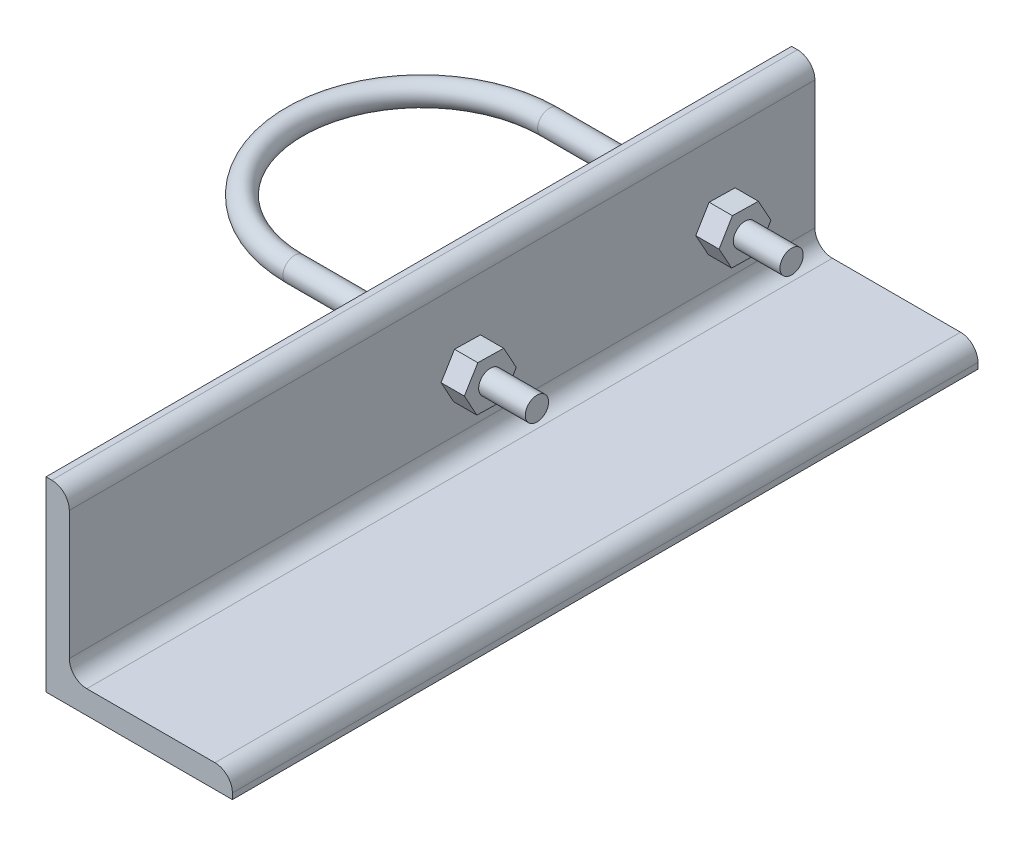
ISO-10303-21;
HEADER;
FILE_DESCRIPTION(('STEP AP214'),'2;1');
FILE_NAME('part.step','',(''),(''),'','','');
FILE_SCHEMA(('AUTOMOTIVE_DESIGN { 1 0 10303 214 1 1 1 1 }'));
ENDSEC;
DATA;
#1=APPLICATION_CONTEXT('core data for automotive mechanical design processes');
#2=APPLICATION_PROTOCOL_DEFINITION('international standard','automotive_design',2000,#1);
#3=PRODUCT_CONTEXT('',#1,'mechanical');
#4=PRODUCT('Part','Part','',(#3));
#5=PRODUCT_RELATED_PRODUCT_CATEGORY('part','',(#4));
#6=PRODUCT_DEFINITION_FORMATION('','',#4);
#7=PRODUCT_DEFINITION_CONTEXT('part definition',#1,'design');
#8=PRODUCT_DEFINITION('design','',#6,#7);
#9=PRODUCT_DEFINITION_SHAPE('','',#8);
#10=(LENGTH_UNIT() NAMED_UNIT(*) SI_UNIT(.MILLI.,.METRE.));
#11=(NAMED_UNIT(*) PLANE_ANGLE_UNIT() SI_UNIT($,.RADIAN.));
#12=(NAMED_UNIT(*) SI_UNIT($,.STERADIAN.) SOLID_ANGLE_UNIT());
#13=UNCERTAINTY_MEASURE_WITH_UNIT(LENGTH_MEASURE(1.E-05),#10,'distance_accuracy_value','');
#14=(GEOMETRIC_REPRESENTATION_CONTEXT(3) GLOBAL_UNCERTAINTY_ASSIGNED_CONTEXT((#13)) GLOBAL_UNIT_ASSIGNED_CONTEXT((#10,
#11,#12)) REPRESENTATION_CONTEXT('',''));
#15=CARTESIAN_POINT('',(0.,0.,0.));
#16=DIRECTION('',(0.,0.,1.));
#17=DIRECTION('',(1.,0.,0.));
#18=AXIS2_PLACEMENT_3D('',#15,#16,#17);
#19=CARTESIAN_POINT('',(50.8,0.,101.6));
#20=DIRECTION('',(0.,1.,0.));
#21=DIRECTION('',(-1.,0.,0.));
#22=AXIS2_PLACEMENT_3D('',#19,#20,#21);
#23=PLANE('',#22);
#24=DIRECTION('',(1.,0.,0.));
#25=VECTOR('',#24,1.);
#26=CARTESIAN_POINT('',(50.8,0.,-101.6));
#27=LINE('',#26,#25);
#28=CARTESIAN_POINT('',(0.,0.,-101.6));
#29=VERTEX_POINT('',#28);
#30=CARTESIAN_POINT('',(50.8,0.,-101.6));
#31=VERTEX_POINT('',#30);
#32=EDGE_CURVE('E313',#29,#31,#27,.T.);
#33=ORIENTED_EDGE('',*,*,#32,.T.);
#34=DIRECTION('',(0.,0.,-1.));
#35=VECTOR('',#34,1.);
#36=CARTESIAN_POINT('',(50.8,0.,101.6));
#37=LINE('',#36,#35);
#38=CARTESIAN_POINT('',(50.8,0.,101.6));
#39=VERTEX_POINT('',#38);
#40=EDGE_CURVE('E39',#39,#31,#37,.T.);
#41=ORIENTED_EDGE('',*,*,#40,.F.);
#42=DIRECTION('',(1.,0.,0.));
#43=VECTOR('',#42,1.);
#44=CARTESIAN_POINT('',(50.8,0.,101.6));
#45=LINE('',#44,#43);
#46=CARTESIAN_POINT('',(0.,0.,101.6));
#47=VERTEX_POINT('',#46);
#48=EDGE_CURVE('E292',#47,#39,#45,.T.);
#49=ORIENTED_EDGE('',*,*,#48,.F.);
#50=DIRECTION('',(0.,0.,-1.));
#51=VECTOR('',#50,1.);
#52=CARTESIAN_POINT('',(0.,0.,101.6));
#53=LINE('',#52,#51);
#54=EDGE_CURVE('E312',#47,#29,#53,.T.);
#55=ORIENTED_EDGE('',*,*,#54,.T.);
#56=EDGE_LOOP('',(#33,#41,#49,#55));
#57=FACE_BOUND('',#56,.T.);
#58=ADVANCED_FACE('F32',(#57),#23,.F.);
#59=CARTESIAN_POINT('',(50.8,1.59258,101.6));
#60=DIRECTION('',(-1.,0.,0.));
#61=DIRECTION('',(0.,0.,1.));
#62=AXIS2_PLACEMENT_3D('',#59,#60,#61);
#63=PLANE('',#62);
#64=DIRECTION('',(0.,1.,0.));
#65=VECTOR('',#64,1.);
#66=CARTESIAN_POINT('',(50.8,1.59258,-101.6));
#67=LINE('',#66,#65);
#68=CARTESIAN_POINT('',(50.8,1.59258,-101.6));
#69=VERTEX_POINT('',#68);
#70=EDGE_CURVE('E316',#31,#69,#67,.T.);
#71=ORIENTED_EDGE('',*,*,#70,.T.);
#72=DIRECTION('',(0.,0.,-1.));
#73=VECTOR('',#72,1.);
#74=CARTESIAN_POINT('',(50.8,1.59258,101.6));
#75=LINE('',#74,#73);
#76=CARTESIAN_POINT('',(50.8,1.59258,101.6));
#77=VERTEX_POINT('',#76);
#78=EDGE_CURVE('E351',#77,#69,#75,.T.);
#79=ORIENTED_EDGE('',*,*,#78,.F.);
#80=DIRECTION('',(0.,1.,0.));
#81=VECTOR('',#80,1.);
#82=CARTESIAN_POINT('',(50.8,1.59258,101.6));
#83=LINE('',#82,#81);
#84=EDGE_CURVE('E295',#39,#77,#83,.T.);
#85=ORIENTED_EDGE('',*,*,#84,.F.);
#86=ORIENTED_EDGE('',*,*,#40,.T.);
#87=EDGE_LOOP('',(#71,#79,#85,#86));
#88=FACE_BOUND('',#87,.T.);
#89=ADVANCED_FACE('F439',(#88),#63,.F.);
#90=CARTESIAN_POINT('',(46.04258,1.59258,101.6));
#91=DIRECTION('',(0.,0.,-1.));
#92=DIRECTION('',(-1.,0.,0.));
#93=AXIS2_PLACEMENT_3D('',#90,#91,#92);
#94=CYLINDRICAL_SURFACE('',#93,4.75742);
#95=CARTESIAN_POINT('',(46.04258,1.59258,-101.6));
#96=DIRECTION('',(0.,0.,1.));
#97=DIRECTION('',(1.,0.,0.));
#98=AXIS2_PLACEMENT_3D('',#95,#96,#97);
#99=CIRCLE('',#98,4.75742);
#100=CARTESIAN_POINT('',(46.04258,6.34999999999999,-101.6));
#101=VERTEX_POINT('',#100);
#102=EDGE_CURVE('E318',#69,#101,#99,.T.);
#103=ORIENTED_EDGE('',*,*,#102,.T.);
#104=DIRECTION('',(0.,0.,-1.));
#105=VECTOR('',#104,1.);
#106=CARTESIAN_POINT('',(46.04258,6.34999999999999,101.6));
#107=LINE('',#106,#105);
#108=CARTESIAN_POINT('',(46.04258,6.34999999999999,101.6));
#109=VERTEX_POINT('',#108);
#110=EDGE_CURVE('E348',#109,#101,#107,.T.);
#111=ORIENTED_EDGE('',*,*,#110,.F.);
#112=CARTESIAN_POINT('',(46.04258,1.59258,101.6));
#113=DIRECTION('',(0.,0.,1.));
#114=DIRECTION('',(1.,0.,0.));
#115=AXIS2_PLACEMENT_3D('',#112,#113,#114);
#116=CIRCLE('',#115,4.75742);
#117=EDGE_CURVE('E298',#77,#109,#116,.T.);
#118=ORIENTED_EDGE('',*,*,#117,.F.);
#119=ORIENTED_EDGE('',*,*,#78,.T.);
#120=EDGE_LOOP('',(#103,#111,#118,#119));
#121=FACE_BOUND('',#120,.T.);
#122=ADVANCED_FACE('F436',(#121),#94,.T.);
#123=CARTESIAN_POINT('',(11.1125,6.34999999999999,101.6));
#124=DIRECTION('',(0.,-1.,0.));
#125=DIRECTION('',(1.,0.,0.));
#126=AXIS2_PLACEMENT_3D('',#123,#124,#125);
#127=PLANE('',#126);
#128=DIRECTION('',(-1.,0.,0.));
#129=VECTOR('',#128,1.);
#130=CARTESIAN_POINT('',(11.1125,6.34999999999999,-101.6));
#131=LINE('',#130,#129);
#132=CARTESIAN_POINT('',(11.1125,6.34999999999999,-101.6));
#133=VERTEX_POINT('',#132);
#134=EDGE_CURVE('E320',#101,#133,#131,.T.);
#135=ORIENTED_EDGE('',*,*,#134,.T.);
#136=DIRECTION('',(0.,0.,-1.));
#137=VECTOR('',#136,1.);
#138=CARTESIAN_POINT('',(11.1125,6.34999999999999,101.6));
#139=LINE('',#138,#137);
#140=CARTESIAN_POINT('',(11.1125,6.34999999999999,101.6));
#141=VERTEX_POINT('',#140);
#142=EDGE_CURVE('E345',#141,#133,#139,.T.);
#143=ORIENTED_EDGE('',*,*,#142,.F.);
#144=DIRECTION('',(-1.,0.,0.));
#145=VECTOR('',#144,1.);
#146=CARTESIAN_POINT('',(11.1125,6.34999999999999,101.6));
#147=LINE('',#146,#145);
#148=EDGE_CURVE('E300',#109,#141,#147,.T.);
#149=ORIENTED_EDGE('',*,*,#148,.F.);
#150=ORIENTED_EDGE('',*,*,#110,.T.);
#151=EDGE_LOOP('',(#135,#143,#149,#150));
#152=FACE_BOUND('',#151,.T.);
#153=ADVANCED_FACE('F432',(#152),#127,.F.);
#154=CARTESIAN_POINT('',(11.1125,11.1125,101.6));
#155=DIRECTION('',(0.,0.,-1.));
#156=DIRECTION('',(-1.,0.,0.));
#157=AXIS2_PLACEMENT_3D('',#154,#155,#156);
#158=CYLINDRICAL_SURFACE('',#157,4.7625);
#159=CARTESIAN_POINT('',(11.1125,11.1125,-101.6));
#160=DIRECTION('',(0.,0.,-1.));
#161=DIRECTION('',(-1.,0.,0.));
#162=AXIS2_PLACEMENT_3D('',#159,#160,#161);
#163=CIRCLE('',#162,4.7625);
#164=CARTESIAN_POINT('',(6.35,11.1125,-101.6));
#165=VERTEX_POINT('',#164);
#166=EDGE_CURVE('E322',#133,#165,#163,.T.);
#167=ORIENTED_EDGE('',*,*,#166,.T.);
#168=DIRECTION('',(0.,0.,-1.));
#169=VECTOR('',#168,1.);
#170=CARTESIAN_POINT('',(6.35,11.1125,101.6));
#171=LINE('',#170,#169);
#172=CARTESIAN_POINT('',(6.35,11.1125,101.6));
#173=VERTEX_POINT('',#172);
#174=EDGE_CURVE('E342',#173,#165,#171,.T.);
#175=ORIENTED_EDGE('',*,*,#174,.F.);
#176=CARTESIAN_POINT('',(11.1125,11.1125,101.6));
#177=DIRECTION('',(0.,0.,-1.));
#178=DIRECTION('',(-1.,0.,0.));
#179=AXIS2_PLACEMENT_3D('',#176,#177,#178);
#180=CIRCLE('',#179,4.7625);
#181=EDGE_CURVE('E302',#141,#173,#180,.T.);
#182=ORIENTED_EDGE('',*,*,#181,.F.);
#183=ORIENTED_EDGE('',*,*,#142,.T.);
#184=EDGE_LOOP('',(#167,#175,#182,#183));
#185=FACE_BOUND('',#184,.T.);
#186=ADVANCED_FACE('F396',(#185),#158,.F.);
#187=CARTESIAN_POINT('',(6.35,46.04258,101.6));
#188=DIRECTION('',(-1.,0.,0.));
#189=DIRECTION('',(0.,-1.,0.));
#190=AXIS2_PLACEMENT_3D('',#187,#188,#189);
#191=PLANE('',#190);
#192=DIRECTION('',(0.,-0.0198848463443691,-0.999802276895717));
#193=VECTOR('',#192,1.);
#194=CARTESIAN_POINT('',(6.35000000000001,31.5945192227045,-3.37868909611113));
#195=LINE('',#194,#193);
#196=CARTESIAN_POINT('',(6.35000000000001,31.5945192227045,-3.37868909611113));
#197=VERTEX_POINT('',#196);
#198=CARTESIAN_POINT('',(6.35000000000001,31.4538734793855,-10.450301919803));
#199=VERTEX_POINT('',#198);
#200=EDGE_CURVE('E200',#197,#199,#195,.T.);
#201=ORIENTED_EDGE('',*,*,#200,.T.);
#202=DIRECTION('',(0.,-0.875796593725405,-0.482680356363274));
#203=VECTOR('',#202,1.);
#204=CARTESIAN_POINT('',(6.35000000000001,31.4538734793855,-10.450301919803));
#205=LINE('',#204,#203);
#206=CARTESIAN_POINT('',(6.35000000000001,25.259354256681,-13.8643055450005));
#207=VERTEX_POINT('',#206);
#208=EDGE_CURVE('E214',#199,#207,#205,.T.);
#209=ORIENTED_EDGE('',*,*,#208,.T.);
#210=DIRECTION('',(0.,-0.855911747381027,0.517121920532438));
#211=VECTOR('',#210,1.);
#212=CARTESIAN_POINT('',(6.35000000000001,25.259354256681,-13.8643055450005));
#213=LINE('',#212,#211);
#214=CARTESIAN_POINT('',(6.35,19.2054807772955,-10.2066963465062));
#215=VERTEX_POINT('',#214);
#216=EDGE_CURVE('E179',#207,#215,#213,.T.);
#217=ORIENTED_EDGE('',*,*,#216,.T.);
#218=DIRECTION('',(0.,0.0198848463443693,0.999802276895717));
#219=VECTOR('',#218,1.);
#220=CARTESIAN_POINT('',(6.35000000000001,19.2054807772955,-10.2066963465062));
#221=LINE('',#220,#219);
#222=CARTESIAN_POINT('',(6.35000000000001,19.3461265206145,-3.13508352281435));
#223=VERTEX_POINT('',#222);
#224=EDGE_CURVE('E46',#215,#223,#221,.T.);
#225=ORIENTED_EDGE('',*,*,#224,.T.);
#226=DIRECTION('',(0.,0.875796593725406,0.482680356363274));
#227=VECTOR('',#226,1.);
#228=CARTESIAN_POINT('',(6.35000000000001,19.3461265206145,-3.13508352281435));
#229=LINE('',#228,#227);
#230=CARTESIAN_POINT('',(6.35000000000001,25.540645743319,0.278920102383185));
#231=VERTEX_POINT('',#230);
#232=EDGE_CURVE('E218',#223,#231,#229,.T.);
#233=ORIENTED_EDGE('',*,*,#232,.T.);
#234=DIRECTION('',(0.,0.855911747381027,-0.517121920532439));
#235=VECTOR('',#234,1.);
#236=CARTESIAN_POINT('',(6.35000000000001,25.540645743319,0.278920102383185));
#237=LINE('',#236,#235);
#238=EDGE_CURVE('E203',#231,#197,#237,.T.);
#239=ORIENTED_EDGE('',*,*,#238,.T.);
#240=EDGE_LOOP('',(#201,#209,#217,#225,#233,#239));
#241=FACE_BOUND('',#240,.T.);
#242=DIRECTION('',(0.,-0.0184269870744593,-0.999830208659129));
#243=VECTOR('',#242,1.);
#244=CARTESIAN_POINT('',(6.35000000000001,31.5895345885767,-72.776967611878));
#245=LINE('',#244,#243);
#246=CARTESIAN_POINT('',(6.35000000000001,31.5895345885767,-72.776967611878));
#247=VERTEX_POINT('',#246);
#248=CARTESIAN_POINT('',(6.35000000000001,31.4592003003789,-79.8487779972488));
#249=VERTEX_POINT('',#248);
#250=EDGE_CURVE('E236',#247,#249,#245,.T.);
#251=ORIENTED_EDGE('',*,*,#250,.T.);
#252=DIRECTION('',(0.,-0.875091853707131,-0.483956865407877));
#253=VECTOR('',#252,1.);
#254=CARTESIAN_POINT('',(6.35000000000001,31.4592003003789,-79.8487779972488));
#255=LINE('',#254,#253);
#256=CARTESIAN_POINT('',(6.35000000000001,25.2696657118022,-83.2718103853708));
#257=VERTEX_POINT('',#256);
#258=EDGE_CURVE('E224',#249,#257,#255,.T.);
#259=ORIENTED_EDGE('',*,*,#258,.T.);
#260=DIRECTION('',(0.,-0.856664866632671,0.515873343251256));
#261=VECTOR('',#260,1.);
#262=CARTESIAN_POINT('',(6.35000000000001,25.2696657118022,-83.2718103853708));
#263=LINE('',#262,#261);
#264=CARTESIAN_POINT('',(6.35,19.2104654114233,-79.6230323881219));
#265=VERTEX_POINT('',#264);
#266=EDGE_CURVE('E254',#257,#265,#263,.T.);
#267=ORIENTED_EDGE('',*,*,#266,.T.);
#268=DIRECTION('',(0.,0.0184269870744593,0.999830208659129));
#269=VECTOR('',#268,1.);
#270=CARTESIAN_POINT('',(6.35000000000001,19.2104654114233,-79.6230323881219));
#271=LINE('',#270,#269);
#272=CARTESIAN_POINT('',(6.35000000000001,19.3407996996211,-72.5512220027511));
#273=VERTEX_POINT('',#272);
#274=EDGE_CURVE('E54',#265,#273,#271,.T.);
#275=ORIENTED_EDGE('',*,*,#274,.T.);
#276=DIRECTION('',(0.,0.875091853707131,0.483956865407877));
#277=VECTOR('',#276,1.);
#278=CARTESIAN_POINT('',(6.35000000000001,19.3407996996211,-72.5512220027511));
#279=LINE('',#278,#277);
#280=CARTESIAN_POINT('',(6.35000000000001,25.5303342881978,-69.1281896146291));
#281=VERTEX_POINT('',#280);
#282=EDGE_CURVE('E258',#273,#281,#279,.T.);
#283=ORIENTED_EDGE('',*,*,#282,.T.);
#284=DIRECTION('',(0.,0.856664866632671,-0.515873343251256));
#285=VECTOR('',#284,1.);
#286=CARTESIAN_POINT('',(6.35000000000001,25.5303342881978,-69.1281896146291));
#287=LINE('',#286,#285);
#288=EDGE_CURVE('E261',#281,#247,#287,.T.);
#289=ORIENTED_EDGE('',*,*,#288,.T.);
#290=EDGE_LOOP('',(#251,#259,#267,#275,#283,#289));
#291=FACE_BOUND('',#290,.T.);
#292=DIRECTION('',(0.,1.,0.));
#293=VECTOR('',#292,1.);
#294=CARTESIAN_POINT('',(6.35,46.04258,-101.6));
#295=LINE('',#294,#293);
#296=CARTESIAN_POINT('',(6.35,46.04258,-101.6));
#297=VERTEX_POINT('',#296);
#298=EDGE_CURVE('E324',#165,#297,#295,.T.);
#299=ORIENTED_EDGE('',*,*,#298,.T.);
#300=DIRECTION('',(0.,0.,-1.));
#301=VECTOR('',#300,1.);
#302=CARTESIAN_POINT('',(6.35,46.04258,101.6));
#303=LINE('',#302,#301);
#304=CARTESIAN_POINT('',(6.35,46.04258,101.6));
#305=VERTEX_POINT('',#304);
#306=EDGE_CURVE('E339',#305,#297,#303,.T.);
#307=ORIENTED_EDGE('',*,*,#306,.F.);
#308=DIRECTION('',(0.,1.,0.));
#309=VECTOR('',#308,1.);
#310=CARTESIAN_POINT('',(6.35,46.04258,101.6));
#311=LINE('',#310,#309);
#312=EDGE_CURVE('E304',#173,#305,#311,.T.);
#313=ORIENTED_EDGE('',*,*,#312,.F.);
#314=ORIENTED_EDGE('',*,*,#174,.T.);
#315=EDGE_LOOP('',(#299,#307,#313,#314));
#316=FACE_BOUND('',#315,.T.);
#317=ADVANCED_FACE('F392',(#241,#291,#316),#191,.F.);
#318=CARTESIAN_POINT('',(1.59258,46.04258,101.6));
#319=DIRECTION('',(0.,0.,-1.));
#320=DIRECTION('',(-1.,0.,0.));
#321=AXIS2_PLACEMENT_3D('',#318,#319,#320);
#322=CYLINDRICAL_SURFACE('',#321,4.75742);
#323=CARTESIAN_POINT('',(1.59258,46.04258,-101.6));
#324=DIRECTION('',(0.,0.,1.));
#325=DIRECTION('',(-1.,0.,0.));
#326=AXIS2_PLACEMENT_3D('',#323,#324,#325);
#327=CIRCLE('',#326,4.75742);
#328=CARTESIAN_POINT('',(1.59258,50.8,-101.6));
#329=VERTEX_POINT('',#328);
#330=EDGE_CURVE('E326',#297,#329,#327,.T.);
#331=ORIENTED_EDGE('',*,*,#330,.T.);
#332=DIRECTION('',(0.,0.,-1.));
#333=VECTOR('',#332,1.);
#334=CARTESIAN_POINT('',(1.59258,50.8,101.6));
#335=LINE('',#334,#333);
#336=CARTESIAN_POINT('',(1.59258,50.8,101.6));
#337=VERTEX_POINT('',#336);
#338=EDGE_CURVE('E336',#337,#329,#335,.T.);
#339=ORIENTED_EDGE('',*,*,#338,.F.);
#340=CARTESIAN_POINT('',(1.59258,46.04258,101.6));
#341=DIRECTION('',(0.,0.,1.));
#342=DIRECTION('',(-1.,0.,0.));
#343=AXIS2_PLACEMENT_3D('',#340,#341,#342);
#344=CIRCLE('',#343,4.75742);
#345=EDGE_CURVE('E306',#305,#337,#344,.T.);
#346=ORIENTED_EDGE('',*,*,#345,.F.);
#347=ORIENTED_EDGE('',*,*,#306,.T.);
#348=EDGE_LOOP('',(#331,#339,#346,#347));
#349=FACE_BOUND('',#348,.T.);
#350=ADVANCED_FACE('F395',(#349),#322,.T.);
#351=CARTESIAN_POINT('',(0.,50.8,101.6));
#352=DIRECTION('',(0.,-1.,0.));
#353=DIRECTION('',(0.,0.,-1.));
#354=AXIS2_PLACEMENT_3D('',#351,#352,#353);
#355=PLANE('',#354);
#356=DIRECTION('',(-1.,0.,0.));
#357=VECTOR('',#356,1.);
#358=CARTESIAN_POINT('',(0.,50.8,-101.6));
#359=LINE('',#358,#357);
#360=CARTESIAN_POINT('',(0.,50.8,-101.6));
#361=VERTEX_POINT('',#360);
#362=EDGE_CURVE('E328',#329,#361,#359,.T.);
#363=ORIENTED_EDGE('',*,*,#362,.T.);
#364=DIRECTION('',(0.,0.,-1.));
#365=VECTOR('',#364,1.);
#366=CARTESIAN_POINT('',(0.,50.8,101.6));
#367=LINE('',#366,#365);
#368=CARTESIAN_POINT('',(0.,50.8,101.6));
#369=VERTEX_POINT('',#368);
#370=EDGE_CURVE('E333',#369,#361,#367,.T.);
#371=ORIENTED_EDGE('',*,*,#370,.F.);
#372=DIRECTION('',(-1.,0.,0.));
#373=VECTOR('',#372,1.);
#374=CARTESIAN_POINT('',(0.,50.8,101.6));
#375=LINE('',#374,#373);
#376=EDGE_CURVE('E308',#337,#369,#375,.T.);
#377=ORIENTED_EDGE('',*,*,#376,.F.);
#378=ORIENTED_EDGE('',*,*,#338,.T.);
#379=EDGE_LOOP('',(#363,#371,#377,#378));
#380=FACE_BOUND('',#379,.T.);
#381=ADVANCED_FACE('F415',(#380),#355,.F.);
#382=CARTESIAN_POINT('',(0.,0.,101.6));
#383=DIRECTION('',(1.,0.,0.));
#384=DIRECTION('',(0.,0.,-1.));
#385=AXIS2_PLACEMENT_3D('',#382,#383,#384);
#386=PLANE('',#385);
#387=CARTESIAN_POINT('',(0.,25.4,-6.79269272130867));
#388=DIRECTION('',(1.,0.,0.));
#389=DIRECTION('',(0.,0.,-1.));
#390=AXIS2_PLACEMENT_3D('',#387,#388,#389);
#391=CIRCLE('',#390,3.17499999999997);
#392=CARTESIAN_POINT('',(0.,25.4,-9.96769272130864));
#393=VERTEX_POINT('',#392);
#394=EDGE_CURVE('E284',#393,#393,#391,.T.);
#395=ORIENTED_EDGE('',*,*,#394,.T.);
#396=EDGE_LOOP('',(#395));
#397=FACE_BOUND('',#396,.T.);
#398=CARTESIAN_POINT('',(0.,25.4,-76.1999999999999));
#399=DIRECTION('',(1.,0.,0.));
#400=DIRECTION('',(0.,0.,-1.));
#401=AXIS2_PLACEMENT_3D('',#398,#399,#400);
#402=CIRCLE('',#401,3.17499999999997);
#403=CARTESIAN_POINT('',(0.,25.4,-79.3749999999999));
#404=VERTEX_POINT('',#403);
#405=EDGE_CURVE('E291',#404,#404,#402,.T.);
#406=ORIENTED_EDGE('',*,*,#405,.T.);
#407=EDGE_LOOP('',(#406));
#408=FACE_BOUND('',#407,.T.);
#409=DIRECTION('',(0.,-1.,0.));
#410=VECTOR('',#409,1.);
#411=CARTESIAN_POINT('',(0.,0.,-101.6));
#412=LINE('',#411,#410);
#413=EDGE_CURVE('E296',#361,#29,#412,.T.);
#414=ORIENTED_EDGE('',*,*,#413,.T.);
#415=ORIENTED_EDGE('',*,*,#54,.F.);
#416=DIRECTION('',(0.,-1.,0.));
#417=VECTOR('',#416,1.);
#418=CARTESIAN_POINT('',(0.,0.,101.6));
#419=LINE('',#418,#417);
#420=EDGE_CURVE('E310',#369,#47,#419,.T.);
#421=ORIENTED_EDGE('',*,*,#420,.F.);
#422=ORIENTED_EDGE('',*,*,#370,.T.);
#423=EDGE_LOOP('',(#414,#415,#421,#422));
#424=FACE_BOUND('',#423,.T.);
#425=ADVANCED_FACE('F419',(#397,#408,#424),#386,.F.);
#426=CARTESIAN_POINT('',(1.59258,46.04258,101.6));
#427=DIRECTION('',(0.,0.,-1.));
#428=DIRECTION('',(-1.,0.,0.));
#429=AXIS2_PLACEMENT_3D('',#426,#427,#428);
#430=PLANE('',#429);
#431=ORIENTED_EDGE('',*,*,#48,.T.);
#432=ORIENTED_EDGE('',*,*,#84,.T.);
#433=ORIENTED_EDGE('',*,*,#117,.T.);
#434=ORIENTED_EDGE('',*,*,#148,.T.);
#435=ORIENTED_EDGE('',*,*,#181,.T.);
#436=ORIENTED_EDGE('',*,*,#312,.T.);
#437=ORIENTED_EDGE('',*,*,#345,.T.);
#438=ORIENTED_EDGE('',*,*,#376,.T.);
#439=ORIENTED_EDGE('',*,*,#420,.T.);
#440=EDGE_LOOP('',(#431,#432,#433,#434,#435,#436,#437,#438,#439));
#441=FACE_BOUND('',#440,.T.);
#442=ADVANCED_FACE('F423',(#441),#430,.F.);
#443=CARTESIAN_POINT('',(1.59258,46.04258,-101.6));
#444=DIRECTION('',(0.,0.,-1.));
#445=DIRECTION('',(-1.,0.,0.));
#446=AXIS2_PLACEMENT_3D('',#443,#444,#445);
#447=PLANE('',#446);
#448=ORIENTED_EDGE('',*,*,#32,.F.);
#449=ORIENTED_EDGE('',*,*,#413,.F.);
#450=ORIENTED_EDGE('',*,*,#362,.F.);
#451=ORIENTED_EDGE('',*,*,#330,.F.);
#452=ORIENTED_EDGE('',*,*,#298,.F.);
#453=ORIENTED_EDGE('',*,*,#166,.F.);
#454=ORIENTED_EDGE('',*,*,#134,.F.);
#455=ORIENTED_EDGE('',*,*,#102,.F.);
#456=ORIENTED_EDGE('',*,*,#70,.F.);
#457=EDGE_LOOP('',(#448,#449,#450,#451,#452,#453,#454,#455,#456));
#458=FACE_BOUND('',#457,.T.);
#459=ADVANCED_FACE('F411',(#458),#447,.T.);
#460=CARTESIAN_POINT('',(25.4,25.4,-76.1999999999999));
#461=DIRECTION('',(-1.,0.,0.));
#462=DIRECTION('',(0.,0.,1.));
#463=AXIS2_PLACEMENT_3D('',#460,#461,#462);
#464=CYLINDRICAL_SURFACE('',#463,3.17499999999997);
#465=CARTESIAN_POINT('',(-40.64,25.4,-76.1999999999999));
#466=DIRECTION('',(-1.,0.,0.));
#467=DIRECTION('',(0.,0.,1.));
#468=AXIS2_PLACEMENT_3D('',#465,#466,#467);
#469=CIRCLE('',#468,3.17499999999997);
#470=CARTESIAN_POINT('',(-40.64,25.4,-79.3749999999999));
#471=VERTEX_POINT('',#470);
#472=EDGE_CURVE('E285',#471,#471,#469,.T.);
#473=ORIENTED_EDGE('',*,*,#472,.F.);
#474=EDGE_LOOP('',(#473));
#475=FACE_BOUND('',#474,.T.);
#476=ORIENTED_EDGE('',*,*,#405,.F.);
#477=EDGE_LOOP('',(#476));
#478=FACE_BOUND('',#477,.T.);
#479=ADVANCED_FACE('F463',(#475,#478),#464,.T.);
#480=CARTESIAN_POINT('',(25.4,25.4,-6.79269272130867));
#481=DIRECTION('',(-1.,0.,0.));
#482=DIRECTION('',(0.,0.,1.));
#483=AXIS2_PLACEMENT_3D('',#480,#481,#482);
#484=CYLINDRICAL_SURFACE('',#483,3.17499999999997);
#485=CARTESIAN_POINT('',(-40.64,25.4,-6.79269272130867));
#486=DIRECTION('',(-1.,0.,0.));
#487=DIRECTION('',(0.,0.,1.));
#488=AXIS2_PLACEMENT_3D('',#485,#486,#487);
#489=CIRCLE('',#488,3.17499999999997);
#490=CARTESIAN_POINT('',(-40.64,25.4,-3.6176927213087));
#491=VERTEX_POINT('',#490);
#492=EDGE_CURVE('E278',#491,#491,#489,.T.);
#493=ORIENTED_EDGE('',*,*,#492,.F.);
#494=EDGE_LOOP('',(#493));
#495=FACE_BOUND('',#494,.T.);
#496=ORIENTED_EDGE('',*,*,#394,.F.);
#497=EDGE_LOOP('',(#496));
#498=FACE_BOUND('',#497,.T.);
#499=ADVANCED_FACE('F477',(#495,#498),#484,.T.);
#500=CARTESIAN_POINT('',(-40.64,25.4,-41.4963463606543));
#501=DIRECTION('',(0.,-1.,0.));
#502=DIRECTION('',(0.,0.,-1.));
#503=AXIS2_PLACEMENT_3D('',#500,#501,#502);
#504=TOROIDAL_SURFACE('',#503,34.7036536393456,3.17499999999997);
#505=CARTESIAN_POINT('',(-40.64,25.4,-41.4963463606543));
#506=DIRECTION('',(0.,-1.,0.));
#507=DIRECTION('',(0.,0.,-1.));
#508=AXIS2_PLACEMENT_3D('',#505,#506,#507);
#509=CIRCLE('',#508,37.8786536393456);
#510=EDGE_CURVE('',#491,#471,#509,.T.);
#511=ORIENTED_EDGE('',*,*,#492,.T.);
#512=ORIENTED_EDGE('',*,*,#472,.T.);
#513=ORIENTED_EDGE('',*,*,#510,.T.);
#514=ORIENTED_EDGE('',*,*,#510,.F.);
#515=EDGE_LOOP('',(#511,#513,#512,#514));
#516=FACE_BOUND('',#515,.T.);
#517=ADVANCED_FACE('F481',(#516),#504,.T.);
#518=CARTESIAN_POINT('',(12.7,31.4592003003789,-79.8487779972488));
#519=DIRECTION('',(0.,0.483956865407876,-0.875091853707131));
#520=DIRECTION('',(0.,0.875091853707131,0.483956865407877));
#521=AXIS2_PLACEMENT_3D('',#518,#519,#520);
#522=PLANE('',#521);
#523=ORIENTED_EDGE('',*,*,#258,.F.);
#524=DIRECTION('',(-1.,0.,0.));
#525=VECTOR('',#524,1.);
#526=CARTESIAN_POINT('',(12.7,31.4592003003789,-79.8487779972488));
#527=LINE('',#526,#525);
#528=CARTESIAN_POINT('',(12.7,31.4592003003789,-79.8487779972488));
#529=VERTEX_POINT('',#528);
#530=EDGE_CURVE('E266',#529,#249,#527,.T.);
#531=ORIENTED_EDGE('',*,*,#530,.F.);
#532=DIRECTION('',(0.,-0.875091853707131,-0.483956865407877));
#533=VECTOR('',#532,1.);
#534=CARTESIAN_POINT('',(12.7,31.4592003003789,-79.8487779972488));
#535=LINE('',#534,#533);
#536=CARTESIAN_POINT('',(12.7,25.2696657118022,-83.2718103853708));
#537=VERTEX_POINT('',#536);
#538=EDGE_CURVE('E232',#529,#537,#535,.T.);
#539=ORIENTED_EDGE('',*,*,#538,.T.);
#540=DIRECTION('',(-1.,0.,0.));
#541=VECTOR('',#540,1.);
#542=CARTESIAN_POINT('',(12.7,25.2696657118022,-83.2718103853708));
#543=LINE('',#542,#541);
#544=EDGE_CURVE('E251',#537,#257,#543,.T.);
#545=ORIENTED_EDGE('',*,*,#544,.T.);
#546=EDGE_LOOP('',(#523,#531,#539,#545));
#547=FACE_BOUND('',#546,.T.);
#548=ADVANCED_FACE('F390',(#547),#522,.T.);
#549=CARTESIAN_POINT('',(12.7,31.5895345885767,-72.776967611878));
#550=DIRECTION('',(0.,0.999830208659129,-0.0184269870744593));
#551=DIRECTION('',(0.,0.0184269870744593,0.999830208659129));
#552=AXIS2_PLACEMENT_3D('',#549,#550,#551);
#553=PLANE('',#552);
#554=ORIENTED_EDGE('',*,*,#250,.F.);
#555=DIRECTION('',(-1.,0.,0.));
#556=VECTOR('',#555,1.);
#557=CARTESIAN_POINT('',(12.7,31.5895345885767,-72.776967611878));
#558=LINE('',#557,#556);
#559=CARTESIAN_POINT('',(12.7,31.5895345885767,-72.776967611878));
#560=VERTEX_POINT('',#559);
#561=EDGE_CURVE('E269',#560,#247,#558,.T.);
#562=ORIENTED_EDGE('',*,*,#561,.F.);
#563=DIRECTION('',(0.,-0.0184269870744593,-0.999830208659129));
#564=VECTOR('',#563,1.);
#565=CARTESIAN_POINT('',(12.7,31.5895345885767,-72.776967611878));
#566=LINE('',#565,#564);
#567=EDGE_CURVE('E248',#560,#529,#566,.T.);
#568=ORIENTED_EDGE('',*,*,#567,.T.);
#569=ORIENTED_EDGE('',*,*,#530,.T.);
#570=EDGE_LOOP('',(#554,#562,#568,#569));
#571=FACE_BOUND('',#570,.T.);
#572=ADVANCED_FACE('F378',(#571),#553,.T.);
#573=CARTESIAN_POINT('',(12.7,25.5303342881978,-69.1281896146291));
#574=DIRECTION('',(0.,0.515873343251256,0.856664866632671));
#575=DIRECTION('',(0.,-0.856664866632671,0.515873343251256));
#576=AXIS2_PLACEMENT_3D('',#573,#574,#575);
#577=PLANE('',#576);
#578=ORIENTED_EDGE('',*,*,#288,.F.);
#579=DIRECTION('',(-1.,0.,0.));
#580=VECTOR('',#579,1.);
#581=CARTESIAN_POINT('',(12.7,25.5303342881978,-69.1281896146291));
#582=LINE('',#581,#580);
#583=CARTESIAN_POINT('',(12.7,25.5303342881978,-69.1281896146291));
#584=VERTEX_POINT('',#583);
#585=EDGE_CURVE('E271',#584,#281,#582,.T.);
#586=ORIENTED_EDGE('',*,*,#585,.F.);
#587=DIRECTION('',(0.,0.856664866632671,-0.515873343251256));
#588=VECTOR('',#587,1.);
#589=CARTESIAN_POINT('',(12.7,25.5303342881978,-69.1281896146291));
#590=LINE('',#589,#588);
#591=EDGE_CURVE('E245',#584,#560,#590,.T.);
#592=ORIENTED_EDGE('',*,*,#591,.T.);
#593=ORIENTED_EDGE('',*,*,#561,.T.);
#594=EDGE_LOOP('',(#578,#586,#592,#593));
#595=FACE_BOUND('',#594,.T.);
#596=ADVANCED_FACE('F382',(#595),#577,.T.);
#597=CARTESIAN_POINT('',(12.7,19.3407996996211,-72.5512220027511));
#598=DIRECTION('',(0.,-0.483956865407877,0.875091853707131));
#599=DIRECTION('',(0.,-0.875091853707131,-0.483956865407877));
#600=AXIS2_PLACEMENT_3D('',#597,#598,#599);
#601=PLANE('',#600);
#602=ORIENTED_EDGE('',*,*,#282,.F.);
#603=DIRECTION('',(-1.,0.,0.));
#604=VECTOR('',#603,1.);
#605=CARTESIAN_POINT('',(12.7,19.3407996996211,-72.5512220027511));
#606=LINE('',#605,#604);
#607=CARTESIAN_POINT('',(12.7,19.3407996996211,-72.5512220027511));
#608=VERTEX_POINT('',#607);
#609=EDGE_CURVE('E273',#608,#273,#606,.T.);
#610=ORIENTED_EDGE('',*,*,#609,.F.);
#611=DIRECTION('',(0.,0.875091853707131,0.483956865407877));
#612=VECTOR('',#611,1.);
#613=CARTESIAN_POINT('',(12.7,19.3407996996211,-72.5512220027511));
#614=LINE('',#613,#612);
#615=EDGE_CURVE('E242',#608,#584,#614,.T.);
#616=ORIENTED_EDGE('',*,*,#615,.T.);
#617=ORIENTED_EDGE('',*,*,#585,.T.);
#618=EDGE_LOOP('',(#602,#610,#616,#617));
#619=FACE_BOUND('',#618,.T.);
#620=ADVANCED_FACE('F386',(#619),#601,.T.);
#621=CARTESIAN_POINT('',(12.7,19.2104654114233,-79.6230323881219));
#622=DIRECTION('',(0.,-0.999830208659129,0.0184269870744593));
#623=DIRECTION('',(0.,-0.0184269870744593,-0.999830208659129));
#624=AXIS2_PLACEMENT_3D('',#621,#622,#623);
#625=PLANE('',#624);
#626=ORIENTED_EDGE('',*,*,#274,.F.);
#627=DIRECTION('',(-1.,0.,0.));
#628=VECTOR('',#627,1.);
#629=CARTESIAN_POINT('',(12.7,19.2104654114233,-79.6230323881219));
#630=LINE('',#629,#628);
#631=CARTESIAN_POINT('',(12.7,19.2104654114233,-79.6230323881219));
#632=VERTEX_POINT('',#631);
#633=EDGE_CURVE('E275',#632,#265,#630,.T.);
#634=ORIENTED_EDGE('',*,*,#633,.F.);
#635=DIRECTION('',(0.,0.0184269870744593,0.999830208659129));
#636=VECTOR('',#635,1.);
#637=CARTESIAN_POINT('',(12.7,19.2104654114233,-79.6230323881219));
#638=LINE('',#637,#636);
#639=EDGE_CURVE('E239',#632,#608,#638,.T.);
#640=ORIENTED_EDGE('',*,*,#639,.T.);
#641=ORIENTED_EDGE('',*,*,#609,.T.);
#642=EDGE_LOOP('',(#626,#634,#640,#641));
#643=FACE_BOUND('',#642,.T.);
#644=ADVANCED_FACE('F387',(#643),#625,.T.);
#645=CARTESIAN_POINT('',(12.7,25.2696657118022,-83.2718103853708));
#646=DIRECTION('',(0.,-0.515873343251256,-0.856664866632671));
#647=DIRECTION('',(0.,0.856664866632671,-0.515873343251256));
#648=AXIS2_PLACEMENT_3D('',#645,#646,#647);
#649=PLANE('',#648);
#650=ORIENTED_EDGE('',*,*,#266,.F.);
#651=ORIENTED_EDGE('',*,*,#544,.F.);
#652=DIRECTION('',(0.,-0.856664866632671,0.515873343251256));
#653=VECTOR('',#652,1.);
#654=CARTESIAN_POINT('',(12.7,25.2696657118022,-83.2718103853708));
#655=LINE('',#654,#653);
#656=EDGE_CURVE('E235',#537,#632,#655,.T.);
#657=ORIENTED_EDGE('',*,*,#656,.T.);
#658=ORIENTED_EDGE('',*,*,#633,.T.);
#659=EDGE_LOOP('',(#650,#651,#657,#658));
#660=FACE_BOUND('',#659,.T.);
#661=ADVANCED_FACE('F368',(#660),#649,.T.);
#662=CARTESIAN_POINT('',(12.7,25.2696657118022,-83.2718103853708));
#663=DIRECTION('',(-1.,0.,0.));
#664=DIRECTION('',(0.,-1.,0.));
#665=AXIS2_PLACEMENT_3D('',#662,#663,#664);
#666=PLANE('',#665);
#667=CARTESIAN_POINT('',(12.7,25.4,-76.1999999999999));
#668=DIRECTION('',(-1.,0.,0.));
#669=DIRECTION('',(0.,-1.,0.));
#670=AXIS2_PLACEMENT_3D('',#667,#668,#669);
#671=CIRCLE('',#670,3.17499999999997);
#672=CARTESIAN_POINT('',(12.7,22.225,-76.1999999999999));
#673=VERTEX_POINT('',#672);
#674=EDGE_CURVE('E268',#673,#673,#671,.F.);
#675=ORIENTED_EDGE('',*,*,#674,.F.);
#676=EDGE_LOOP('',(#675));
#677=FACE_BOUND('',#676,.T.);
#678=ORIENTED_EDGE('',*,*,#538,.F.);
#679=ORIENTED_EDGE('',*,*,#567,.F.);
#680=ORIENTED_EDGE('',*,*,#591,.F.);
#681=ORIENTED_EDGE('',*,*,#615,.F.);
#682=ORIENTED_EDGE('',*,*,#639,.F.);
#683=ORIENTED_EDGE('',*,*,#656,.F.);
#684=EDGE_LOOP('',(#678,#679,#680,#681,#682,#683));
#685=FACE_BOUND('',#684,.T.);
#686=ADVANCED_FACE('F364',(#677,#685),#666,.F.);
#687=CARTESIAN_POINT('',(25.4,25.4,-76.1999999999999));
#688=DIRECTION('',(-1.,0.,0.));
#689=DIRECTION('',(0.,0.,1.));
#690=AXIS2_PLACEMENT_3D('',#687,#688,#689);
#691=PLANE('',#690);
#692=CARTESIAN_POINT('',(25.4,25.4,-76.1999999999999));
#693=DIRECTION('',(-1.,0.,0.));
#694=DIRECTION('',(0.,0.,1.));
#695=AXIS2_PLACEMENT_3D('',#692,#693,#694);
#696=CIRCLE('',#695,3.17499999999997);
#697=CARTESIAN_POINT('',(25.4,25.4,-73.025));
#698=VERTEX_POINT('',#697);
#699=EDGE_CURVE('E288',#698,#698,#696,.T.);
#700=ORIENTED_EDGE('',*,*,#699,.F.);
#701=EDGE_LOOP('',(#700));
#702=FACE_BOUND('',#701,.T.);
#703=ADVANCED_FACE('F367',(#702),#691,.F.);
#704=ORIENTED_EDGE('',*,*,#699,.T.);
#705=EDGE_LOOP('',(#704));
#706=FACE_BOUND('',#705,.T.);
#707=ORIENTED_EDGE('',*,*,#674,.T.);
#708=EDGE_LOOP('',(#707));
#709=FACE_BOUND('',#708,.T.);
#710=ADVANCED_FACE('F362',(#706,#709),#464,.T.);
#711=CARTESIAN_POINT('',(12.7,31.4538734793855,-10.450301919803));
#712=DIRECTION('',(0.,0.482680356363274,-0.875796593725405));
#713=DIRECTION('',(0.,0.875796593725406,0.482680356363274));
#714=AXIS2_PLACEMENT_3D('',#711,#712,#713);
#715=PLANE('',#714);
#716=ORIENTED_EDGE('',*,*,#208,.F.);
#717=DIRECTION('',(-1.,0.,0.));
#718=VECTOR('',#717,1.);
#719=CARTESIAN_POINT('',(12.7,31.4538734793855,-10.450301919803));
#720=LINE('',#719,#718);
#721=CARTESIAN_POINT('',(12.7,31.4538734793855,-10.450301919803));
#722=VERTEX_POINT('',#721);
#723=EDGE_CURVE('E199',#722,#199,#720,.T.);
#724=ORIENTED_EDGE('',*,*,#723,.F.);
#725=DIRECTION('',(0.,-0.875796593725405,-0.482680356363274));
#726=VECTOR('',#725,1.);
#727=CARTESIAN_POINT('',(12.7,31.4538734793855,-10.450301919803));
#728=LINE('',#727,#726);
#729=CARTESIAN_POINT('',(12.7,25.259354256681,-13.8643055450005));
#730=VERTEX_POINT('',#729);
#731=EDGE_CURVE('E192',#722,#730,#728,.T.);
#732=ORIENTED_EDGE('',*,*,#731,.T.);
#733=DIRECTION('',(-1.,0.,0.));
#734=VECTOR('',#733,1.);
#735=CARTESIAN_POINT('',(12.7,25.259354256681,-13.8643055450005));
#736=LINE('',#735,#734);
#737=EDGE_CURVE('E174',#730,#207,#736,.T.);
#738=ORIENTED_EDGE('',*,*,#737,.T.);
#739=EDGE_LOOP('',(#716,#724,#732,#738));
#740=FACE_BOUND('',#739,.T.);
#741=ADVANCED_FACE('F198',(#740),#715,.T.);
#742=CARTESIAN_POINT('',(12.7,31.5945192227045,-3.37868909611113));
#743=DIRECTION('',(0.,0.999802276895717,-0.0198848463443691));
#744=DIRECTION('',(0.,0.0198848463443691,0.999802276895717));
#745=AXIS2_PLACEMENT_3D('',#742,#743,#744);
#746=PLANE('',#745);
#747=ORIENTED_EDGE('',*,*,#200,.F.);
#748=DIRECTION('',(-1.,0.,0.));
#749=VECTOR('',#748,1.);
#750=CARTESIAN_POINT('',(12.7,31.5945192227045,-3.37868909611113));
#751=LINE('',#750,#749);
#752=CARTESIAN_POINT('',(12.7,31.5945192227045,-3.37868909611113));
#753=VERTEX_POINT('',#752);
#754=EDGE_CURVE('E225',#753,#197,#751,.T.);
#755=ORIENTED_EDGE('',*,*,#754,.F.);
#756=DIRECTION('',(0.,-0.0198848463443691,-0.999802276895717));
#757=VECTOR('',#756,1.);
#758=CARTESIAN_POINT('',(12.7,31.5945192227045,-3.37868909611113));
#759=LINE('',#758,#757);
#760=EDGE_CURVE('E185',#753,#722,#759,.T.);
#761=ORIENTED_EDGE('',*,*,#760,.T.);
#762=ORIENTED_EDGE('',*,*,#723,.T.);
#763=EDGE_LOOP('',(#747,#755,#761,#762));
#764=FACE_BOUND('',#763,.T.);
#765=ADVANCED_FACE('F499',(#764),#746,.T.);
#766=CARTESIAN_POINT('',(12.7,25.540645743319,0.278920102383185));
#767=DIRECTION('',(0.,0.517121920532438,0.855911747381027));
#768=DIRECTION('',(0.,-0.855911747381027,0.517121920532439));
#769=AXIS2_PLACEMENT_3D('',#766,#767,#768);
#770=PLANE('',#769);
#771=ORIENTED_EDGE('',*,*,#238,.F.);
#772=DIRECTION('',(-1.,0.,0.));
#773=VECTOR('',#772,1.);
#774=CARTESIAN_POINT('',(12.7,25.540645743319,0.278920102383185));
#775=LINE('',#774,#773);
#776=CARTESIAN_POINT('',(12.7,25.540645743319,0.278920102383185));
#777=VERTEX_POINT('',#776);
#778=EDGE_CURVE('E227',#777,#231,#775,.T.);
#779=ORIENTED_EDGE('',*,*,#778,.F.);
#780=DIRECTION('',(0.,0.855911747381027,-0.517121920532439));
#781=VECTOR('',#780,1.);
#782=CARTESIAN_POINT('',(12.7,25.540645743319,0.278920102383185));
#783=LINE('',#782,#781);
#784=EDGE_CURVE('E210',#777,#753,#783,.T.);
#785=ORIENTED_EDGE('',*,*,#784,.T.);
#786=ORIENTED_EDGE('',*,*,#754,.T.);
#787=EDGE_LOOP('',(#771,#779,#785,#786));
#788=FACE_BOUND('',#787,.T.);
#789=ADVANCED_FACE('F508',(#788),#770,.T.);
#790=CARTESIAN_POINT('',(12.7,19.3461265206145,-3.13508352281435));
#791=DIRECTION('',(0.,-0.482680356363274,0.875796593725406));
#792=DIRECTION('',(0.,-0.875796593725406,-0.482680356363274));
#793=AXIS2_PLACEMENT_3D('',#790,#791,#792);
#794=PLANE('',#793);
#795=ORIENTED_EDGE('',*,*,#232,.F.);
#796=DIRECTION('',(-1.,0.,0.));
#797=VECTOR('',#796,1.);
#798=CARTESIAN_POINT('',(12.7,19.3461265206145,-3.13508352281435));
#799=LINE('',#798,#797);
#800=CARTESIAN_POINT('',(12.7,19.3461265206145,-3.13508352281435));
#801=VERTEX_POINT('',#800);
#802=EDGE_CURVE('E229',#801,#223,#799,.T.);
#803=ORIENTED_EDGE('',*,*,#802,.F.);
#804=DIRECTION('',(0.,0.875796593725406,0.482680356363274));
#805=VECTOR('',#804,1.);
#806=CARTESIAN_POINT('',(12.7,19.3461265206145,-3.13508352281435));
#807=LINE('',#806,#805);
#808=EDGE_CURVE('E207',#801,#777,#807,.T.);
#809=ORIENTED_EDGE('',*,*,#808,.T.);
#810=ORIENTED_EDGE('',*,*,#778,.T.);
#811=EDGE_LOOP('',(#795,#803,#809,#810));
#812=FACE_BOUND('',#811,.T.);
#813=ADVANCED_FACE('F505',(#812),#794,.T.);
#814=CARTESIAN_POINT('',(12.7,19.2054807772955,-10.2066963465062));
#815=DIRECTION('',(0.,-0.999802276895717,0.0198848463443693));
#816=DIRECTION('',(0.,-0.0198848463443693,-0.999802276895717));
#817=AXIS2_PLACEMENT_3D('',#814,#815,#816);
#818=PLANE('',#817);
#819=ORIENTED_EDGE('',*,*,#224,.F.);
#820=DIRECTION('',(-1.,0.,0.));
#821=VECTOR('',#820,1.);
#822=CARTESIAN_POINT('',(12.7,19.2054807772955,-10.2066963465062));
#823=LINE('',#822,#821);
#824=CARTESIAN_POINT('',(12.7,19.2054807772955,-10.2066963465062));
#825=VERTEX_POINT('',#824);
#826=EDGE_CURVE('E184',#825,#215,#823,.T.);
#827=ORIENTED_EDGE('',*,*,#826,.F.);
#828=DIRECTION('',(0.,0.0198848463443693,0.999802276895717));
#829=VECTOR('',#828,1.);
#830=CARTESIAN_POINT('',(12.7,19.2054807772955,-10.2066963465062));
#831=LINE('',#830,#829);
#832=EDGE_CURVE('E196',#825,#801,#831,.T.);
#833=ORIENTED_EDGE('',*,*,#832,.T.);
#834=ORIENTED_EDGE('',*,*,#802,.T.);
#835=EDGE_LOOP('',(#819,#827,#833,#834));
#836=FACE_BOUND('',#835,.T.);
#837=ADVANCED_FACE('F502',(#836),#818,.T.);
#838=CARTESIAN_POINT('',(12.7,25.259354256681,-13.8643055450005));
#839=DIRECTION('',(0.,-0.517121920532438,-0.855911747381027));
#840=DIRECTION('',(0.,0.855911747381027,-0.517121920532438));
#841=AXIS2_PLACEMENT_3D('',#838,#839,#840);
#842=PLANE('',#841);
#843=ORIENTED_EDGE('',*,*,#216,.F.);
#844=ORIENTED_EDGE('',*,*,#737,.F.);
#845=DIRECTION('',(0.,-0.855911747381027,0.517121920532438));
#846=VECTOR('',#845,1.);
#847=CARTESIAN_POINT('',(12.7,25.259354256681,-13.8643055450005));
#848=LINE('',#847,#846);
#849=EDGE_CURVE('E177',#730,#825,#848,.T.);
#850=ORIENTED_EDGE('',*,*,#849,.T.);
#851=ORIENTED_EDGE('',*,*,#826,.T.);
#852=EDGE_LOOP('',(#843,#844,#850,#851));
#853=FACE_BOUND('',#852,.T.);
#854=ADVANCED_FACE('F176',(#853),#842,.T.);
#855=CARTESIAN_POINT('',(12.7,31.4538734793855,-10.450301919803));
#856=DIRECTION('',(1.,0.,0.));
#857=DIRECTION('',(0.,1.,0.));
#858=AXIS2_PLACEMENT_3D('',#855,#856,#857);
#859=PLANE('',#858);
#860=CARTESIAN_POINT('',(12.7,25.4,-6.79269272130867));
#861=DIRECTION('',(1.,0.,0.));
#862=DIRECTION('',(0.,1.,0.));
#863=AXIS2_PLACEMENT_3D('',#860,#861,#862);
#864=CIRCLE('',#863,3.17499999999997);
#865=CARTESIAN_POINT('',(12.7,28.575,-6.79269272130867));
#866=VERTEX_POINT('',#865);
#867=EDGE_CURVE('E11',#866,#866,#864,.F.);
#868=ORIENTED_EDGE('',*,*,#867,.T.);
#869=EDGE_LOOP('',(#868));
#870=FACE_BOUND('',#869,.T.);
#871=ORIENTED_EDGE('',*,*,#731,.F.);
#872=ORIENTED_EDGE('',*,*,#760,.F.);
#873=ORIENTED_EDGE('',*,*,#784,.F.);
#874=ORIENTED_EDGE('',*,*,#808,.F.);
#875=ORIENTED_EDGE('',*,*,#832,.F.);
#876=ORIENTED_EDGE('',*,*,#849,.F.);
#877=EDGE_LOOP('',(#871,#872,#873,#874,#875,#876));
#878=FACE_BOUND('',#877,.T.);
#879=ADVANCED_FACE('F190',(#870,#878),#859,.T.);
#880=CARTESIAN_POINT('',(25.4,25.4,-6.79269272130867));
#881=DIRECTION('',(-1.,0.,0.));
#882=DIRECTION('',(0.,0.,1.));
#883=AXIS2_PLACEMENT_3D('',#880,#881,#882);
#884=PLANE('',#883);
#885=CARTESIAN_POINT('',(25.4,25.4,-6.79269272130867));
#886=DIRECTION('',(-1.,0.,0.));
#887=DIRECTION('',(0.,0.,1.));
#888=AXIS2_PLACEMENT_3D('',#885,#886,#887);
#889=CIRCLE('',#888,3.17499999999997);
#890=CARTESIAN_POINT('',(25.4,25.4,-3.6176927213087));
#891=VERTEX_POINT('',#890);
#892=EDGE_CURVE('E281',#891,#891,#889,.T.);
#893=ORIENTED_EDGE('',*,*,#892,.F.);
#894=EDGE_LOOP('',(#893));
#895=FACE_BOUND('',#894,.T.);
#896=ADVANCED_FACE('F475',(#895),#884,.F.);
#897=ORIENTED_EDGE('',*,*,#867,.F.);
#898=EDGE_LOOP('',(#897));
#899=FACE_BOUND('',#898,.T.);
#900=ORIENTED_EDGE('',*,*,#892,.T.);
#901=EDGE_LOOP('',(#900));
#902=FACE_BOUND('',#901,.T.);
#903=ADVANCED_FACE('F472',(#899,#902),#484,.T.);
#904=CLOSED_SHELL('',(#58,#89,#122,#153,#186,#317,#350,#381,#425,#442,#459,#479,#499,#517,#548,
#572,#596,#620,#644,#661,#686,#703,#710,#741,#765,#789,#813,#837,#854,#879,#896,#903));
#905=MANIFOLD_SOLID_BREP('B2',#904);
#906=ADVANCED_BREP_SHAPE_REPRESENTATION('',(#18,#905),#14);
#907=SHAPE_DEFINITION_REPRESENTATION(#9,#906);
ENDSEC;
END-ISO-10303-21;
